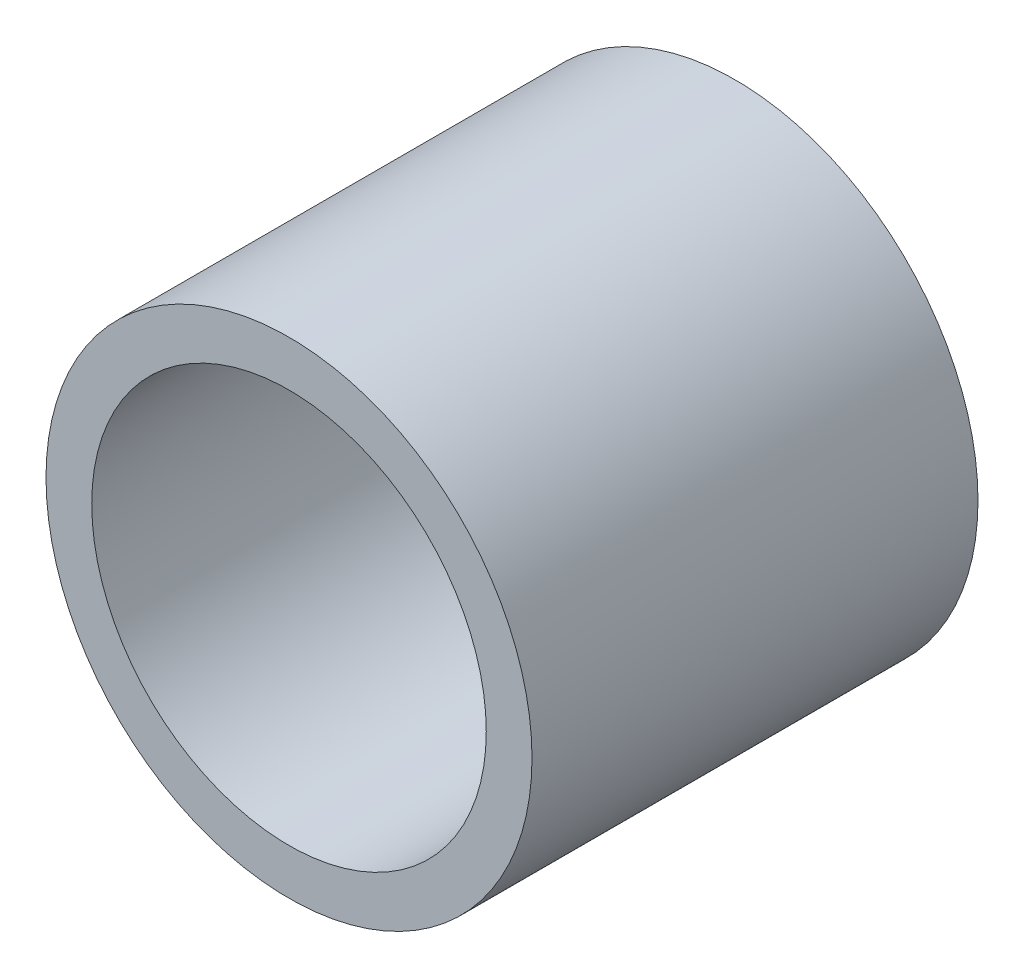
ISO-10303-21;
HEADER;
FILE_DESCRIPTION(('STEP AP214'),'2;1');
FILE_NAME('part.step','',(''),(''),'','','');
FILE_SCHEMA(('AUTOMOTIVE_DESIGN { 1 0 10303 214 1 1 1 1 }'));
ENDSEC;
DATA;
#1=APPLICATION_CONTEXT('core data for automotive mechanical design processes');
#2=APPLICATION_PROTOCOL_DEFINITION('international standard','automotive_design',2000,#1);
#3=PRODUCT_CONTEXT('',#1,'mechanical');
#4=PRODUCT('Part','Part','',(#3));
#5=PRODUCT_RELATED_PRODUCT_CATEGORY('part','',(#4));
#6=PRODUCT_DEFINITION_FORMATION('','',#4);
#7=PRODUCT_DEFINITION_CONTEXT('part definition',#1,'design');
#8=PRODUCT_DEFINITION('design','',#6,#7);
#9=PRODUCT_DEFINITION_SHAPE('','',#8);
#10=(LENGTH_UNIT() NAMED_UNIT(*) SI_UNIT(.MILLI.,.METRE.));
#11=(NAMED_UNIT(*) PLANE_ANGLE_UNIT() SI_UNIT($,.RADIAN.));
#12=(NAMED_UNIT(*) SI_UNIT($,.STERADIAN.) SOLID_ANGLE_UNIT());
#13=UNCERTAINTY_MEASURE_WITH_UNIT(LENGTH_MEASURE(1.E-05),#10,'distance_accuracy_value','');
#14=(GEOMETRIC_REPRESENTATION_CONTEXT(3) GLOBAL_UNCERTAINTY_ASSIGNED_CONTEXT((#13)) GLOBAL_UNIT_ASSIGNED_CONTEXT((#10,
#11,#12)) REPRESENTATION_CONTEXT('',''));
#15=CARTESIAN_POINT('',(0.,0.,0.));
#16=DIRECTION('',(0.,0.,1.));
#17=DIRECTION('',(1.,0.,0.));
#18=AXIS2_PLACEMENT_3D('',#15,#16,#17);
#19=CARTESIAN_POINT('',(0.,0.,19.812));
#20=DIRECTION('',(0.,0.,1.));
#21=DIRECTION('',(1.,0.,0.));
#22=AXIS2_PLACEMENT_3D('',#19,#20,#21);
#23=PLANE('',#22);
#24=CARTESIAN_POINT('',(0.,0.,19.812));
#25=DIRECTION('',(0.,0.,1.));
#26=DIRECTION('',(1.,0.,0.));
#27=AXIS2_PLACEMENT_3D('',#24,#25,#26);
#28=CIRCLE('',#27,10.795);
#29=CARTESIAN_POINT('',(10.795,0.,19.812));
#30=VERTEX_POINT('',#29);
#31=EDGE_CURVE('E10',#30,#30,#28,.T.);
#32=ORIENTED_EDGE('',*,*,#31,.T.);
#33=EDGE_LOOP('',(#32));
#34=FACE_BOUND('',#33,.T.);
#35=CARTESIAN_POINT('',(0.,0.,19.812));
#36=DIRECTION('',(0.,0.,1.));
#37=DIRECTION('',(1.,0.,0.));
#38=AXIS2_PLACEMENT_3D('',#35,#36,#37);
#39=CIRCLE('',#38,8.76299999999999);
#40=CARTESIAN_POINT('',(8.76300000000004,0.,19.812));
#41=VERTEX_POINT('',#40);
#42=EDGE_CURVE('E39',#41,#41,#39,.T.);
#43=ORIENTED_EDGE('',*,*,#42,.F.);
#44=EDGE_LOOP('',(#43));
#45=FACE_BOUND('',#44,.T.);
#46=ADVANCED_FACE('F28',(#34,#45),#23,.T.);
#47=CARTESIAN_POINT('',(0.,0.,0.));
#48=DIRECTION('',(0.,0.,1.));
#49=DIRECTION('',(1.,0.,0.));
#50=AXIS2_PLACEMENT_3D('',#47,#48,#49);
#51=PLANE('',#50);
#52=CARTESIAN_POINT('',(0.,0.,0.));
#53=DIRECTION('',(0.,0.,1.));
#54=DIRECTION('',(1.,0.,0.));
#55=AXIS2_PLACEMENT_3D('',#52,#53,#54);
#56=CIRCLE('',#55,10.795);
#57=CARTESIAN_POINT('',(10.795,0.,0.));
#58=VERTEX_POINT('',#57);
#59=EDGE_CURVE('E35',#58,#58,#56,.T.);
#60=ORIENTED_EDGE('',*,*,#59,.F.);
#61=EDGE_LOOP('',(#60));
#62=FACE_BOUND('',#61,.T.);
#63=CARTESIAN_POINT('',(0.,0.,0.));
#64=DIRECTION('',(0.,0.,1.));
#65=DIRECTION('',(1.,0.,0.));
#66=AXIS2_PLACEMENT_3D('',#63,#64,#65);
#67=CIRCLE('',#66,8.76299999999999);
#68=CARTESIAN_POINT('',(8.76299999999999,0.,0.));
#69=VERTEX_POINT('',#68);
#70=EDGE_CURVE('E43',#69,#69,#67,.T.);
#71=ORIENTED_EDGE('',*,*,#70,.T.);
#72=EDGE_LOOP('',(#71));
#73=FACE_BOUND('',#72,.T.);
#74=ADVANCED_FACE('F49',(#62,#73),#51,.F.);
#75=CARTESIAN_POINT('',(0.,0.,19.812));
#76=DIRECTION('',(0.,0.,-1.));
#77=DIRECTION('',(-1.,0.,0.));
#78=AXIS2_PLACEMENT_3D('',#75,#76,#77);
#79=CYLINDRICAL_SURFACE('',#78,10.795);
#80=ORIENTED_EDGE('',*,*,#31,.F.);
#81=EDGE_LOOP('',(#80));
#82=FACE_BOUND('',#81,.T.);
#83=ORIENTED_EDGE('',*,*,#59,.T.);
#84=EDGE_LOOP('',(#83));
#85=FACE_BOUND('',#84,.T.);
#86=ADVANCED_FACE('F30',(#82,#85),#79,.T.);
#87=CARTESIAN_POINT('',(0.,0.,19.812));
#88=DIRECTION('',(0.,0.,-1.));
#89=DIRECTION('',(-1.,0.,0.));
#90=AXIS2_PLACEMENT_3D('',#87,#88,#89);
#91=CYLINDRICAL_SURFACE('',#90,8.76299999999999);
#92=ORIENTED_EDGE('',*,*,#42,.T.);
#93=EDGE_LOOP('',(#92));
#94=FACE_BOUND('',#93,.T.);
#95=ORIENTED_EDGE('',*,*,#70,.F.);
#96=EDGE_LOOP('',(#95));
#97=FACE_BOUND('',#96,.T.);
#98=ADVANCED_FACE('F51',(#94,#97),#91,.F.);
#99=CLOSED_SHELL('',(#46,#74,#86,#98));
#100=MANIFOLD_SOLID_BREP('B2',#99);
#101=ADVANCED_BREP_SHAPE_REPRESENTATION('',(#18,#100),#14);
#102=SHAPE_DEFINITION_REPRESENTATION(#9,#101);
ENDSEC;
END-ISO-10303-21;
